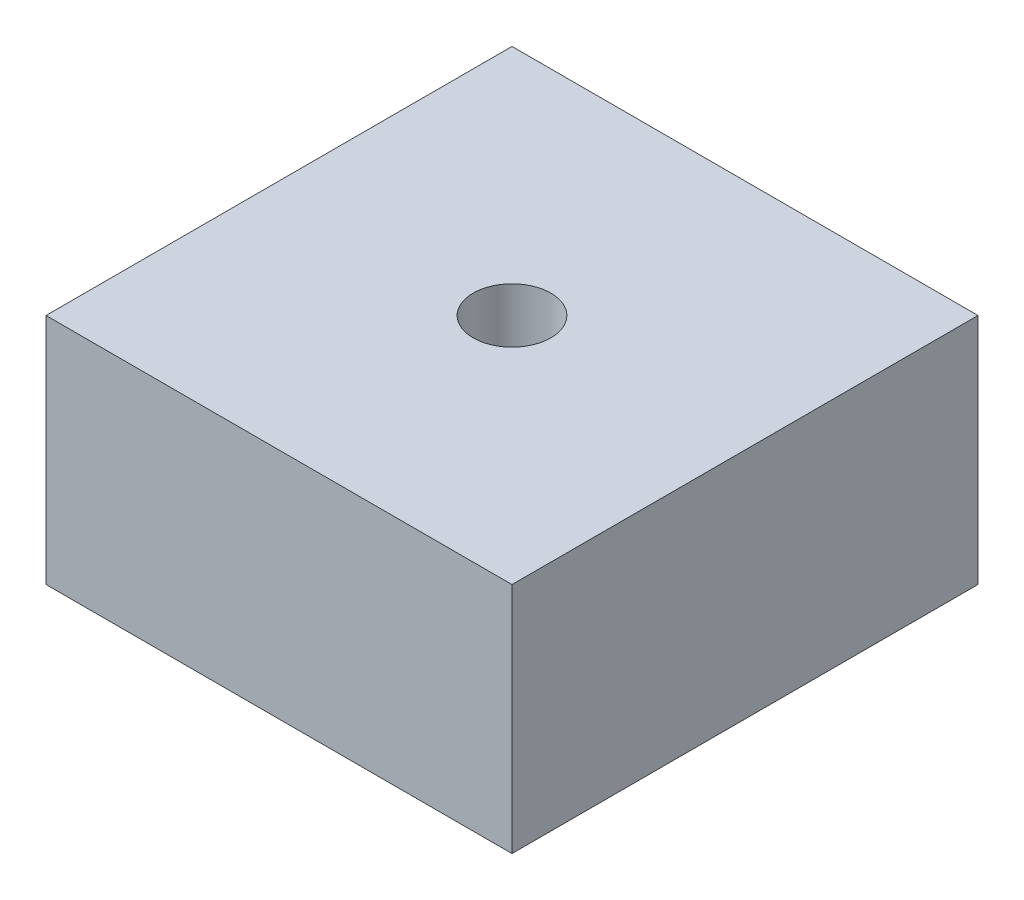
ISO-10303-21;
HEADER;
FILE_DESCRIPTION(('STEP AP214'),'2;1');
FILE_NAME('part.step','',(''),(''),'','','');
FILE_SCHEMA(('AUTOMOTIVE_DESIGN { 1 0 10303 214 1 1 1 1 }'));
ENDSEC;
DATA;
#1=APPLICATION_CONTEXT('core data for automotive mechanical design processes');
#2=APPLICATION_PROTOCOL_DEFINITION('international standard','automotive_design',2000,#1);
#3=PRODUCT_CONTEXT('',#1,'mechanical');
#4=PRODUCT('Part','Part','',(#3));
#5=PRODUCT_RELATED_PRODUCT_CATEGORY('part','',(#4));
#6=PRODUCT_DEFINITION_FORMATION('','',#4);
#7=PRODUCT_DEFINITION_CONTEXT('part definition',#1,'design');
#8=PRODUCT_DEFINITION('design','',#6,#7);
#9=PRODUCT_DEFINITION_SHAPE('','',#8);
#10=(LENGTH_UNIT() NAMED_UNIT(*) SI_UNIT(.MILLI.,.METRE.));
#11=(NAMED_UNIT(*) PLANE_ANGLE_UNIT() SI_UNIT($,.RADIAN.));
#12=(NAMED_UNIT(*) SI_UNIT($,.STERADIAN.) SOLID_ANGLE_UNIT());
#13=UNCERTAINTY_MEASURE_WITH_UNIT(LENGTH_MEASURE(1.E-05),#10,'distance_accuracy_value','');
#14=(GEOMETRIC_REPRESENTATION_CONTEXT(3) GLOBAL_UNCERTAINTY_ASSIGNED_CONTEXT((#13)) GLOBAL_UNIT_ASSIGNED_CONTEXT((#10,
#11,#12)) REPRESENTATION_CONTEXT('',''));
#15=CARTESIAN_POINT('',(0.,0.,0.));
#16=DIRECTION('',(0.,0.,1.));
#17=DIRECTION('',(1.,0.,0.));
#18=AXIS2_PLACEMENT_3D('',#15,#16,#17);
#19=CARTESIAN_POINT('',(19.05,19.05,19.05));
#20=DIRECTION('',(-1.,0.,0.));
#21=DIRECTION('',(0.,0.,1.));
#22=AXIS2_PLACEMENT_3D('',#19,#20,#21);
#23=PLANE('',#22);
#24=DIRECTION('',(0.,0.,-1.));
#25=VECTOR('',#24,1.);
#26=CARTESIAN_POINT('',(19.05,0.,19.05));
#27=LINE('',#26,#25);
#28=CARTESIAN_POINT('',(19.05,0.,19.05));
#29=VERTEX_POINT('',#28);
#30=CARTESIAN_POINT('',(19.05,0.,-19.05));
#31=VERTEX_POINT('',#30);
#32=EDGE_CURVE('E95',#29,#31,#27,.T.);
#33=ORIENTED_EDGE('',*,*,#32,.T.);
#34=DIRECTION('',(0.,-1.,0.));
#35=VECTOR('',#34,1.);
#36=CARTESIAN_POINT('',(19.05,19.05,-19.05));
#37=LINE('',#36,#35);
#38=CARTESIAN_POINT('',(19.05,19.05,-19.05));
#39=VERTEX_POINT('',#38);
#40=EDGE_CURVE('E11',#39,#31,#37,.T.);
#41=ORIENTED_EDGE('',*,*,#40,.F.);
#42=DIRECTION('',(0.,0.,-1.));
#43=VECTOR('',#42,1.);
#44=CARTESIAN_POINT('',(19.05,19.05,19.05));
#45=LINE('',#44,#43);
#46=CARTESIAN_POINT('',(19.05,19.05,19.05));
#47=VERTEX_POINT('',#46);
#48=EDGE_CURVE('E83',#47,#39,#45,.T.);
#49=ORIENTED_EDGE('',*,*,#48,.F.);
#50=DIRECTION('',(0.,-1.,0.));
#51=VECTOR('',#50,1.);
#52=CARTESIAN_POINT('',(19.05,19.05,19.05));
#53=LINE('',#52,#51);
#54=EDGE_CURVE('E91',#47,#29,#53,.T.);
#55=ORIENTED_EDGE('',*,*,#54,.T.);
#56=EDGE_LOOP('',(#33,#41,#49,#55));
#57=FACE_BOUND('',#56,.T.);
#58=ADVANCED_FACE('F32',(#57),#23,.F.);
#59=CARTESIAN_POINT('',(-19.05,19.05,-19.05));
#60=DIRECTION('',(0.,0.,1.));
#61=DIRECTION('',(1.,0.,0.));
#62=AXIS2_PLACEMENT_3D('',#59,#60,#61);
#63=PLANE('',#62);
#64=DIRECTION('',(-1.,0.,0.));
#65=VECTOR('',#64,1.);
#66=CARTESIAN_POINT('',(-19.05,0.,-19.05));
#67=LINE('',#66,#65);
#68=CARTESIAN_POINT('',(-19.05,0.,-19.05));
#69=VERTEX_POINT('',#68);
#70=EDGE_CURVE('E87',#31,#69,#67,.T.);
#71=ORIENTED_EDGE('',*,*,#70,.T.);
#72=DIRECTION('',(0.,-1.,0.));
#73=VECTOR('',#72,1.);
#74=CARTESIAN_POINT('',(-19.05,19.05,-19.05));
#75=LINE('',#74,#73);
#76=CARTESIAN_POINT('',(-19.05,19.05,-19.05));
#77=VERTEX_POINT('',#76);
#78=EDGE_CURVE('E40',#77,#69,#75,.T.);
#79=ORIENTED_EDGE('',*,*,#78,.F.);
#80=DIRECTION('',(-1.,0.,0.));
#81=VECTOR('',#80,1.);
#82=CARTESIAN_POINT('',(-19.05,19.05,-19.05));
#83=LINE('',#82,#81);
#84=EDGE_CURVE('E78',#39,#77,#83,.T.);
#85=ORIENTED_EDGE('',*,*,#84,.F.);
#86=ORIENTED_EDGE('',*,*,#40,.T.);
#87=EDGE_LOOP('',(#71,#79,#85,#86));
#88=FACE_BOUND('',#87,.T.);
#89=ADVANCED_FACE('F86',(#88),#63,.F.);
#90=CARTESIAN_POINT('',(-19.05,19.05,19.05));
#91=DIRECTION('',(1.,0.,0.));
#92=DIRECTION('',(0.,0.,-1.));
#93=AXIS2_PLACEMENT_3D('',#90,#91,#92);
#94=PLANE('',#93);
#95=DIRECTION('',(0.,0.,1.));
#96=VECTOR('',#95,1.);
#97=CARTESIAN_POINT('',(-19.05,0.,19.05));
#98=LINE('',#97,#96);
#99=CARTESIAN_POINT('',(-19.05,0.,19.05));
#100=VERTEX_POINT('',#99);
#101=EDGE_CURVE('E65',#69,#100,#98,.T.);
#102=ORIENTED_EDGE('',*,*,#101,.T.);
#103=DIRECTION('',(0.,-1.,0.));
#104=VECTOR('',#103,1.);
#105=CARTESIAN_POINT('',(-19.05,19.05,19.05));
#106=LINE('',#105,#104);
#107=CARTESIAN_POINT('',(-19.05,19.05,19.05));
#108=VERTEX_POINT('',#107);
#109=EDGE_CURVE('E88',#108,#100,#106,.T.);
#110=ORIENTED_EDGE('',*,*,#109,.F.);
#111=DIRECTION('',(0.,0.,1.));
#112=VECTOR('',#111,1.);
#113=CARTESIAN_POINT('',(-19.05,19.05,19.05));
#114=LINE('',#113,#112);
#115=EDGE_CURVE('E81',#77,#108,#114,.T.);
#116=ORIENTED_EDGE('',*,*,#115,.F.);
#117=ORIENTED_EDGE('',*,*,#78,.T.);
#118=EDGE_LOOP('',(#102,#110,#116,#117));
#119=FACE_BOUND('',#118,.T.);
#120=ADVANCED_FACE('F89',(#119),#94,.F.);
#121=CARTESIAN_POINT('',(-19.05,19.05,19.05));
#122=DIRECTION('',(0.,0.,-1.));
#123=DIRECTION('',(-1.,0.,0.));
#124=AXIS2_PLACEMENT_3D('',#121,#122,#123);
#125=PLANE('',#124);
#126=DIRECTION('',(1.,0.,0.));
#127=VECTOR('',#126,1.);
#128=CARTESIAN_POINT('',(-19.05,0.,19.05));
#129=LINE('',#128,#127);
#130=EDGE_CURVE('E71',#100,#29,#129,.T.);
#131=ORIENTED_EDGE('',*,*,#130,.T.);
#132=ORIENTED_EDGE('',*,*,#54,.F.);
#133=DIRECTION('',(1.,0.,0.));
#134=VECTOR('',#133,1.);
#135=CARTESIAN_POINT('',(-19.05,19.05,19.05));
#136=LINE('',#135,#134);
#137=EDGE_CURVE('E48',#108,#47,#136,.T.);
#138=ORIENTED_EDGE('',*,*,#137,.F.);
#139=ORIENTED_EDGE('',*,*,#109,.T.);
#140=EDGE_LOOP('',(#131,#132,#138,#139));
#141=FACE_BOUND('',#140,.T.);
#142=ADVANCED_FACE('F103',(#141),#125,.F.);
#143=CARTESIAN_POINT('',(0.,19.05,0.));
#144=DIRECTION('',(0.,-1.,0.));
#145=DIRECTION('',(0.,0.,-1.));
#146=AXIS2_PLACEMENT_3D('',#143,#144,#145);
#147=PLANE('',#146);
#148=CARTESIAN_POINT('',(0.,19.05,0.));
#149=DIRECTION('',(0.,1.,0.));
#150=DIRECTION('',(0.,0.,1.));
#151=AXIS2_PLACEMENT_3D('',#148,#149,#150);
#152=CIRCLE('',#151,3.175);
#153=CARTESIAN_POINT('',(0.,19.05,3.175));
#154=VERTEX_POINT('',#153);
#155=EDGE_CURVE('E109',#154,#154,#152,.T.);
#156=ORIENTED_EDGE('',*,*,#155,.F.);
#157=EDGE_LOOP('',(#156));
#158=FACE_BOUND('',#157,.T.);
#159=ORIENTED_EDGE('',*,*,#48,.T.);
#160=ORIENTED_EDGE('',*,*,#84,.T.);
#161=ORIENTED_EDGE('',*,*,#115,.T.);
#162=ORIENTED_EDGE('',*,*,#137,.T.);
#163=EDGE_LOOP('',(#159,#160,#161,#162));
#164=FACE_BOUND('',#163,.T.);
#165=ADVANCED_FACE('F79',(#158,#164),#147,.F.);
#166=CARTESIAN_POINT('',(0.,0.,0.));
#167=DIRECTION('',(0.,-1.,0.));
#168=DIRECTION('',(0.,0.,-1.));
#169=AXIS2_PLACEMENT_3D('',#166,#167,#168);
#170=PLANE('',#169);
#171=CARTESIAN_POINT('',(0.,0.,0.));
#172=DIRECTION('',(0.,1.,0.));
#173=DIRECTION('',(0.,0.,1.));
#174=AXIS2_PLACEMENT_3D('',#171,#172,#173);
#175=CIRCLE('',#174,3.175);
#176=CARTESIAN_POINT('',(0.,0.,3.175));
#177=VERTEX_POINT('',#176);
#178=EDGE_CURVE('E98',#177,#177,#175,.T.);
#179=ORIENTED_EDGE('',*,*,#178,.T.);
#180=EDGE_LOOP('',(#179));
#181=FACE_BOUND('',#180,.T.);
#182=ORIENTED_EDGE('',*,*,#32,.F.);
#183=ORIENTED_EDGE('',*,*,#130,.F.);
#184=ORIENTED_EDGE('',*,*,#101,.F.);
#185=ORIENTED_EDGE('',*,*,#70,.F.);
#186=EDGE_LOOP('',(#182,#183,#184,#185));
#187=FACE_BOUND('',#186,.T.);
#188=ADVANCED_FACE('F106',(#181,#187),#170,.T.);
#189=CARTESIAN_POINT('',(0.,0.,0.));
#190=DIRECTION('',(0.,1.,0.));
#191=DIRECTION('',(0.,0.,1.));
#192=AXIS2_PLACEMENT_3D('',#189,#190,#191);
#193=CYLINDRICAL_SURFACE('',#192,3.175);
#194=CARTESIAN_POINT('',(0.,0.,3.175));
#195=CARTESIAN_POINT('',(0.,0.1984375,3.175));
#196=CARTESIAN_POINT('',(0.,0.396875,3.175));
#197=CARTESIAN_POINT('',(0.,0.79375,3.175));
#198=CARTESIAN_POINT('',(0.,0.9921875,3.175));
#199=CARTESIAN_POINT('',(0.,1.3890625,3.175));
#200=CARTESIAN_POINT('',(0.,1.5875,3.175));
#201=CARTESIAN_POINT('',(0.,1.984375,3.175));
#202=CARTESIAN_POINT('',(0.,2.1828125,3.175));
#203=CARTESIAN_POINT('',(0.,2.5796875,3.175));
#204=CARTESIAN_POINT('',(0.,2.778125,3.175));
#205=CARTESIAN_POINT('',(0.,3.175,3.175));
#206=CARTESIAN_POINT('',(0.,3.3734375,3.175));
#207=CARTESIAN_POINT('',(0.,3.7703125,3.175));
#208=CARTESIAN_POINT('',(0.,3.96875,3.175));
#209=CARTESIAN_POINT('',(0.,4.365625,3.175));
#210=CARTESIAN_POINT('',(0.,4.5640625,3.175));
#211=CARTESIAN_POINT('',(0.,4.9609375,3.175));
#212=CARTESIAN_POINT('',(0.,5.159375,3.175));
#213=CARTESIAN_POINT('',(0.,5.55625,3.175));
#214=CARTESIAN_POINT('',(0.,5.7546875,3.175));
#215=CARTESIAN_POINT('',(0.,6.1515625,3.175));
#216=CARTESIAN_POINT('',(0.,6.35,3.175));
#217=CARTESIAN_POINT('',(0.,6.746875,3.175));
#218=CARTESIAN_POINT('',(0.,6.9453125,3.175));
#219=CARTESIAN_POINT('',(0.,7.3421875,3.175));
#220=CARTESIAN_POINT('',(0.,7.540625,3.175));
#221=CARTESIAN_POINT('',(0.,7.9375,3.175));
#222=CARTESIAN_POINT('',(0.,8.1359375,3.175));
#223=CARTESIAN_POINT('',(0.,8.5328125,3.175));
#224=CARTESIAN_POINT('',(0.,8.73125,3.175));
#225=CARTESIAN_POINT('',(0.,9.128125,3.175));
#226=CARTESIAN_POINT('',(0.,9.3265625,3.175));
#227=CARTESIAN_POINT('',(0.,9.7234375,3.175));
#228=CARTESIAN_POINT('',(0.,9.921875,3.175));
#229=CARTESIAN_POINT('',(0.,10.31875,3.175));
#230=CARTESIAN_POINT('',(0.,10.5171875,3.175));
#231=CARTESIAN_POINT('',(0.,10.9140625,3.175));
#232=CARTESIAN_POINT('',(0.,11.1125,3.175));
#233=CARTESIAN_POINT('',(0.,11.509375,3.175));
#234=CARTESIAN_POINT('',(0.,11.7078125,3.175));
#235=CARTESIAN_POINT('',(0.,12.1046875,3.175));
#236=CARTESIAN_POINT('',(0.,12.303125,3.175));
#237=CARTESIAN_POINT('',(0.,12.7,3.175));
#238=CARTESIAN_POINT('',(0.,12.8984375,3.175));
#239=CARTESIAN_POINT('',(0.,13.2953125,3.175));
#240=CARTESIAN_POINT('',(0.,13.49375,3.175));
#241=CARTESIAN_POINT('',(0.,13.890625,3.175));
#242=CARTESIAN_POINT('',(0.,14.0890625,3.175));
#243=CARTESIAN_POINT('',(0.,14.4859375,3.175));
#244=CARTESIAN_POINT('',(0.,14.684375,3.175));
#245=CARTESIAN_POINT('',(0.,15.08125,3.175));
#246=CARTESIAN_POINT('',(0.,15.2796875,3.175));
#247=CARTESIAN_POINT('',(0.,15.6765625,3.175));
#248=CARTESIAN_POINT('',(0.,15.875,3.175));
#249=CARTESIAN_POINT('',(0.,16.271875,3.175));
#250=CARTESIAN_POINT('',(0.,16.4703125,3.175));
#251=CARTESIAN_POINT('',(0.,16.8671875,3.175));
#252=CARTESIAN_POINT('',(0.,17.065625,3.175));
#253=CARTESIAN_POINT('',(0.,17.4625,3.175));
#254=CARTESIAN_POINT('',(0.,17.6609375,3.175));
#255=CARTESIAN_POINT('',(0.,18.0578125,3.175));
#256=CARTESIAN_POINT('',(0.,18.25625,3.175));
#257=CARTESIAN_POINT('',(0.,18.653125,3.175));
#258=CARTESIAN_POINT('',(0.,18.8515625,3.175));
#259=CARTESIAN_POINT('',(0.,19.05,3.175));
#260=B_SPLINE_CURVE_WITH_KNOTS('',3,(#194,#195,#196,#197,#198,#199,#200,#201,#202,#203,#204,
#205,#206,#207,#208,#209,#210,#211,#212,#213,#214,#215,#216,#217,#218,#219,#220,#221,#222,#223,
#224,#225,#226,#227,#228,#229,#230,#231,#232,#233,#234,#235,#236,#237,#238,#239,#240,#241,#242,
#243,#244,#245,#246,#247,#248,#249,#250,#251,#252,#253,#254,#255,#256,#257,#258,#259),
.UNSPECIFIED.,.F.,.F.,(4,2,2,2,2,2,2,2,2,2,2,2,2,2,2,2,2,2,2,2,2,2,2,2,2,2,2,2,2,2,2,2,4),(0.,
0.5953125,1.190625,1.7859375,2.38125,2.9765625,3.571875,4.1671875,4.7625,5.3578125,5.953125,
6.5484375,7.14375,7.7390625,8.334375,8.9296875,9.525,10.1203125,10.715625,11.3109375,11.90625,
12.5015625,13.096875,13.6921875,14.2875,14.8828125,15.478125,16.0734375,16.66875,17.2640625,
17.859375,18.4546875,19.05),.UNSPECIFIED.);
#261=EDGE_CURVE('BSEAM116',#177,#154,#260,.T.);
#262=ORIENTED_EDGE('',*,*,#178,.F.);
#263=ORIENTED_EDGE('',*,*,#155,.T.);
#264=ORIENTED_EDGE('',*,*,#261,.T.);
#265=ORIENTED_EDGE('',*,*,#261,.F.);
#266=EDGE_LOOP('',(#262,#264,#263,#265));
#267=FACE_BOUND('',#266,.T.);
#268=ADVANCED_FACE('F116',(#267),#193,.F.);
#269=CLOSED_SHELL('',(#58,#89,#120,#142,#165,#188,#268));
#270=MANIFOLD_SOLID_BREP('B2',#269);
#271=ADVANCED_BREP_SHAPE_REPRESENTATION('',(#18,#270),#14);
#272=SHAPE_DEFINITION_REPRESENTATION(#9,#271);
ENDSEC;
END-ISO-10303-21;
